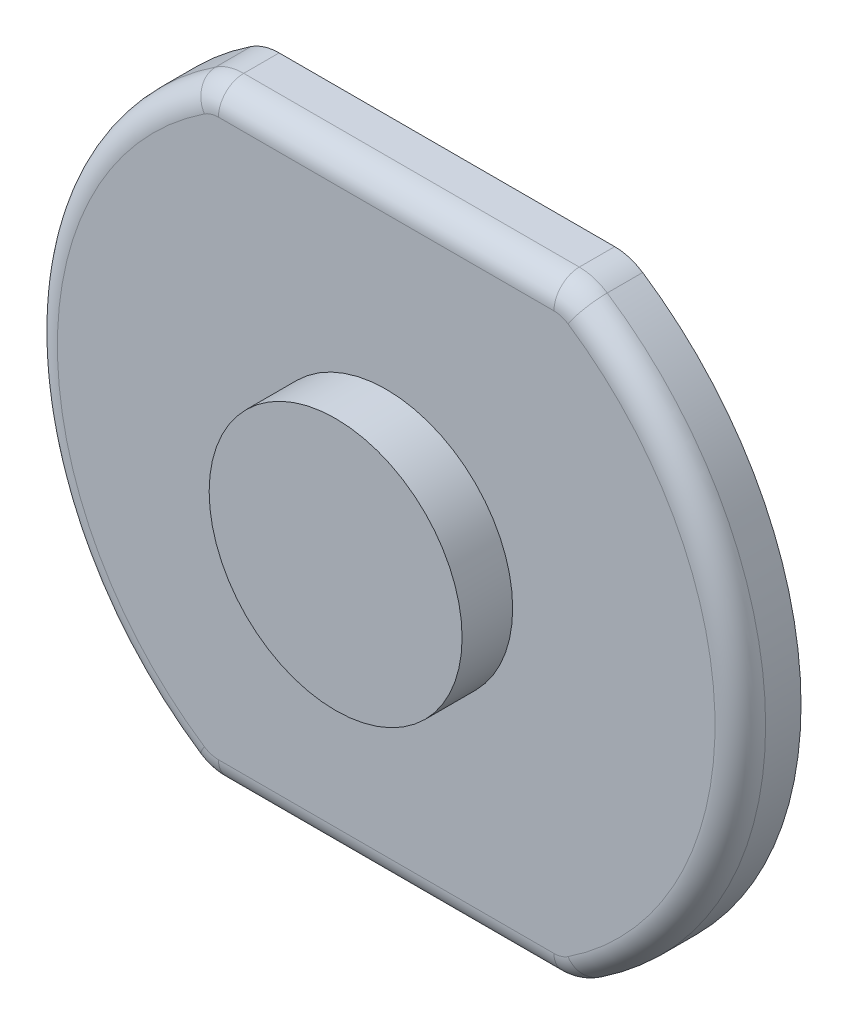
ISO-10303-21;
HEADER;
FILE_DESCRIPTION(('STEP AP214'),'2;1');
FILE_NAME('part.step','',(''),(''),'','','');
FILE_SCHEMA(('AUTOMOTIVE_DESIGN { 1 0 10303 214 1 1 1 1 }'));
ENDSEC;
DATA;
#1=APPLICATION_CONTEXT('core data for automotive mechanical design processes');
#2=APPLICATION_PROTOCOL_DEFINITION('international standard','automotive_design',2000,#1);
#3=PRODUCT_CONTEXT('',#1,'mechanical');
#4=PRODUCT('Part','Part','',(#3));
#5=PRODUCT_RELATED_PRODUCT_CATEGORY('part','',(#4));
#6=PRODUCT_DEFINITION_FORMATION('','',#4);
#7=PRODUCT_DEFINITION_CONTEXT('part definition',#1,'design');
#8=PRODUCT_DEFINITION('design','',#6,#7);
#9=PRODUCT_DEFINITION_SHAPE('','',#8);
#10=(LENGTH_UNIT() NAMED_UNIT(*) SI_UNIT(.MILLI.,.METRE.));
#11=(NAMED_UNIT(*) PLANE_ANGLE_UNIT() SI_UNIT($,.RADIAN.));
#12=(NAMED_UNIT(*) SI_UNIT($,.STERADIAN.) SOLID_ANGLE_UNIT());
#13=UNCERTAINTY_MEASURE_WITH_UNIT(LENGTH_MEASURE(1.E-05),#10,'distance_accuracy_value','');
#14=(GEOMETRIC_REPRESENTATION_CONTEXT(3) GLOBAL_UNCERTAINTY_ASSIGNED_CONTEXT((#13)) GLOBAL_UNIT_ASSIGNED_CONTEXT((#10,
#11,#12)) REPRESENTATION_CONTEXT('',''));
#15=CARTESIAN_POINT('',(0.,0.,0.));
#16=DIRECTION('',(0.,0.,1.));
#17=DIRECTION('',(1.,0.,0.));
#18=AXIS2_PLACEMENT_3D('',#15,#16,#17);
#19=CARTESIAN_POINT('',(0.,0.,1.2));
#20=DIRECTION('',(0.,0.,1.));
#21=DIRECTION('',(1.,0.,0.));
#22=AXIS2_PLACEMENT_3D('',#19,#20,#21);
#23=PLANE('',#22);
#24=DIRECTION('',(-1.,0.,0.));
#25=VECTOR('',#24,1.);
#26=CARTESIAN_POINT('',(-3.3166247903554,5.5,1.2));
#27=LINE('',#26,#25);
#28=CARTESIAN_POINT('',(3.3166247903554,5.5,1.2));
#29=VERTEX_POINT('',#28);
#30=CARTESIAN_POINT('',(-3.3166247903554,5.5,1.2));
#31=VERTEX_POINT('',#30);
#32=EDGE_CURVE('E187',#29,#31,#27,.T.);
#33=ORIENTED_EDGE('',*,*,#32,.T.);
#34=CARTESIAN_POINT('',(-3.3166247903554,5.,1.2));
#35=DIRECTION('',(0.,0.,1.));
#36=DIRECTION('',(1.,0.,0.));
#37=AXIS2_PLACEMENT_3D('',#34,#35,#36);
#38=CIRCLE('',#37,0.5);
#39=CARTESIAN_POINT('',(-3.59301018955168,5.41666666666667,1.2));
#40=VERTEX_POINT('',#39);
#41=EDGE_CURVE('E189',#31,#40,#38,.T.);
#42=ORIENTED_EDGE('',*,*,#41,.T.);
#43=CARTESIAN_POINT('',(0.,0.,1.2));
#44=DIRECTION('',(0.,0.,1.));
#45=DIRECTION('',(1.,0.,0.));
#46=AXIS2_PLACEMENT_3D('',#43,#44,#45);
#47=CIRCLE('',#46,6.5);
#48=CARTESIAN_POINT('',(-3.59301018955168,-5.41666666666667,1.2));
#49=VERTEX_POINT('',#48);
#50=EDGE_CURVE('E127',#40,#49,#47,.T.);
#51=ORIENTED_EDGE('',*,*,#50,.T.);
#52=CARTESIAN_POINT('',(-3.3166247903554,-5.,1.2));
#53=DIRECTION('',(0.,0.,1.));
#54=DIRECTION('',(1.,0.,0.));
#55=AXIS2_PLACEMENT_3D('',#52,#53,#54);
#56=CIRCLE('',#55,0.5);
#57=CARTESIAN_POINT('',(-3.3166247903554,-5.5,1.2));
#58=VERTEX_POINT('',#57);
#59=EDGE_CURVE('E177',#49,#58,#56,.T.);
#60=ORIENTED_EDGE('',*,*,#59,.T.);
#61=DIRECTION('',(1.,0.,0.));
#62=VECTOR('',#61,1.);
#63=CARTESIAN_POINT('',(3.31662479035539,-5.5,1.2));
#64=LINE('',#63,#62);
#65=CARTESIAN_POINT('',(3.31662479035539,-5.5,1.2));
#66=VERTEX_POINT('',#65);
#67=EDGE_CURVE('E179',#58,#66,#64,.T.);
#68=ORIENTED_EDGE('',*,*,#67,.T.);
#69=CARTESIAN_POINT('',(3.31662479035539,-5.,1.2));
#70=DIRECTION('',(0.,0.,1.));
#71=DIRECTION('',(1.,0.,0.));
#72=AXIS2_PLACEMENT_3D('',#69,#70,#71);
#73=CIRCLE('',#72,0.5);
#74=CARTESIAN_POINT('',(3.59301018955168,-5.41666666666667,1.2));
#75=VERTEX_POINT('',#74);
#76=EDGE_CURVE('E181',#66,#75,#73,.T.);
#77=ORIENTED_EDGE('',*,*,#76,.T.);
#78=CARTESIAN_POINT('',(0.,0.,1.2));
#79=DIRECTION('',(0.,0.,1.));
#80=DIRECTION('',(1.,0.,0.));
#81=AXIS2_PLACEMENT_3D('',#78,#79,#80);
#82=CIRCLE('',#81,6.5);
#83=CARTESIAN_POINT('',(3.59301018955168,5.41666666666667,1.2));
#84=VERTEX_POINT('',#83);
#85=EDGE_CURVE('E183',#75,#84,#82,.T.);
#86=ORIENTED_EDGE('',*,*,#85,.T.);
#87=CARTESIAN_POINT('',(3.3166247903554,5.,1.2));
#88=DIRECTION('',(0.,0.,1.));
#89=DIRECTION('',(1.,0.,0.));
#90=AXIS2_PLACEMENT_3D('',#87,#88,#89);
#91=CIRCLE('',#90,0.499999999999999);
#92=EDGE_CURVE('E185',#84,#29,#91,.T.);
#93=ORIENTED_EDGE('',*,*,#92,.T.);
#94=EDGE_LOOP('',(#33,#42,#51,#60,#68,#77,#86,#93));
#95=FACE_BOUND('',#94,.T.);
#96=CARTESIAN_POINT('',(0.,0.,1.2));
#97=DIRECTION('',(0.,0.,1.));
#98=DIRECTION('',(1.,0.,0.));
#99=AXIS2_PLACEMENT_3D('',#96,#97,#98);
#100=CIRCLE('',#99,2.5);
#101=CARTESIAN_POINT('',(2.5,0.,1.2));
#102=VERTEX_POINT('',#101);
#103=EDGE_CURVE('E275',#102,#102,#100,.T.);
#104=ORIENTED_EDGE('',*,*,#103,.F.);
#105=EDGE_LOOP('',(#104));
#106=FACE_BOUND('',#105,.T.);
#107=ADVANCED_FACE('F33',(#95,#106),#23,.T.);
#108=CARTESIAN_POINT('',(0.,0.,1.2));
#109=DIRECTION('',(0.,0.,-1.));
#110=DIRECTION('',(-1.,0.,0.));
#111=AXIS2_PLACEMENT_3D('',#108,#109,#110);
#112=CYLINDRICAL_SURFACE('',#111,7.);
#113=DIRECTION('',(0.,0.,-1.));
#114=VECTOR('',#113,1.);
#115=CARTESIAN_POINT('',(-3.86939558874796,-5.83333333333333,1.2));
#116=LINE('',#115,#114);
#117=CARTESIAN_POINT('',(-3.86939558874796,-5.83333333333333,0.7));
#118=VERTEX_POINT('',#117);
#119=CARTESIAN_POINT('',(-3.86939558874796,-5.83333333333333,0.));
#120=VERTEX_POINT('',#119);
#121=EDGE_CURVE('E119',#118,#120,#116,.T.);
#122=ORIENTED_EDGE('',*,*,#121,.F.);
#123=CARTESIAN_POINT('',(0.,0.,0.7));
#124=DIRECTION('',(0.,0.,1.));
#125=DIRECTION('',(1.,0.,0.));
#126=AXIS2_PLACEMENT_3D('',#123,#124,#125);
#127=CIRCLE('',#126,7.);
#128=CARTESIAN_POINT('',(-3.86939558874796,5.83333333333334,0.7));
#129=VERTEX_POINT('',#128);
#130=EDGE_CURVE('E11',#118,#129,#127,.F.);
#131=ORIENTED_EDGE('',*,*,#130,.T.);
#132=DIRECTION('',(0.,0.,-1.));
#133=VECTOR('',#132,1.);
#134=CARTESIAN_POINT('',(-3.86939558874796,5.83333333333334,1.2));
#135=LINE('',#134,#133);
#136=CARTESIAN_POINT('',(-3.86939558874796,5.83333333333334,0.));
#137=VERTEX_POINT('',#136);
#138=EDGE_CURVE('E140',#129,#137,#135,.T.);
#139=ORIENTED_EDGE('',*,*,#138,.T.);
#140=CARTESIAN_POINT('',(0.,0.,0.));
#141=DIRECTION('',(0.,0.,1.));
#142=DIRECTION('',(1.,0.,0.));
#143=AXIS2_PLACEMENT_3D('',#140,#141,#142);
#144=CIRCLE('',#143,7.);
#145=EDGE_CURVE('E134',#137,#120,#144,.T.);
#146=ORIENTED_EDGE('',*,*,#145,.T.);
#147=EDGE_LOOP('',(#122,#131,#139,#146));
#148=FACE_BOUND('',#147,.T.);
#149=ADVANCED_FACE('F35',(#148),#112,.T.);
#150=CARTESIAN_POINT('',(-3.3166247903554,-5.,1.2));
#151=DIRECTION('',(0.,0.,-1.));
#152=DIRECTION('',(-1.,0.,0.));
#153=AXIS2_PLACEMENT_3D('',#150,#151,#152);
#154=CYLINDRICAL_SURFACE('',#153,1.);
#155=DIRECTION('',(0.,0.,-1.));
#156=VECTOR('',#155,1.);
#157=CARTESIAN_POINT('',(-3.3166247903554,-6.,1.2));
#158=LINE('',#157,#156);
#159=CARTESIAN_POINT('',(-3.3166247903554,-6.,0.7));
#160=VERTEX_POINT('',#159);
#161=CARTESIAN_POINT('',(-3.3166247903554,-6.,0.));
#162=VERTEX_POINT('',#161);
#163=EDGE_CURVE('E128',#160,#162,#158,.T.);
#164=ORIENTED_EDGE('',*,*,#163,.F.);
#165=CARTESIAN_POINT('',(-3.3166247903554,-5.,0.7));
#166=DIRECTION('',(0.,0.,1.));
#167=DIRECTION('',(1.,0.,0.));
#168=AXIS2_PLACEMENT_3D('',#165,#166,#167);
#169=CIRCLE('',#168,1.);
#170=EDGE_CURVE('E41',#160,#118,#169,.F.);
#171=ORIENTED_EDGE('',*,*,#170,.T.);
#172=ORIENTED_EDGE('',*,*,#121,.T.);
#173=CARTESIAN_POINT('',(-3.3166247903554,-5.,0.));
#174=DIRECTION('',(0.,0.,1.));
#175=DIRECTION('',(1.,0.,0.));
#176=AXIS2_PLACEMENT_3D('',#173,#174,#175);
#177=CIRCLE('',#176,1.);
#178=EDGE_CURVE('E122',#120,#162,#177,.T.);
#179=ORIENTED_EDGE('',*,*,#178,.T.);
#180=EDGE_LOOP('',(#164,#171,#172,#179));
#181=FACE_BOUND('',#180,.T.);
#182=ADVANCED_FACE('F121',(#181),#154,.T.);
#183=CARTESIAN_POINT('',(-3.3166247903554,-6.,1.2));
#184=DIRECTION('',(0.,1.,0.));
#185=DIRECTION('',(0.,0.,1.));
#186=AXIS2_PLACEMENT_3D('',#183,#184,#185);
#187=PLANE('',#186);
#188=DIRECTION('',(0.,0.,-1.));
#189=VECTOR('',#188,1.);
#190=CARTESIAN_POINT('',(3.31662479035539,-6.,1.2));
#191=LINE('',#190,#189);
#192=CARTESIAN_POINT('',(3.31662479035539,-6.,0.7));
#193=VERTEX_POINT('',#192);
#194=CARTESIAN_POINT('',(3.31662479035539,-6.,0.));
#195=VERTEX_POINT('',#194);
#196=EDGE_CURVE('E173',#193,#195,#191,.T.);
#197=ORIENTED_EDGE('',*,*,#196,.F.);
#198=DIRECTION('',(1.,0.,0.));
#199=VECTOR('',#198,1.);
#200=CARTESIAN_POINT('',(-3.3166247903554,-6.,0.7));
#201=LINE('',#200,#199);
#202=EDGE_CURVE('E55',#193,#160,#201,.F.);
#203=ORIENTED_EDGE('',*,*,#202,.T.);
#204=ORIENTED_EDGE('',*,*,#163,.T.);
#205=DIRECTION('',(1.,0.,0.));
#206=VECTOR('',#205,1.);
#207=CARTESIAN_POINT('',(-3.3166247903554,-6.,0.));
#208=LINE('',#207,#206);
#209=EDGE_CURVE('E137',#162,#195,#208,.T.);
#210=ORIENTED_EDGE('',*,*,#209,.T.);
#211=EDGE_LOOP('',(#197,#203,#204,#210));
#212=FACE_BOUND('',#211,.T.);
#213=ADVANCED_FACE('F210',(#212),#187,.F.);
#214=CARTESIAN_POINT('',(3.31662479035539,-5.,1.2));
#215=DIRECTION('',(0.,0.,-1.));
#216=DIRECTION('',(-1.,0.,0.));
#217=AXIS2_PLACEMENT_3D('',#214,#215,#216);
#218=CYLINDRICAL_SURFACE('',#217,1.);
#219=DIRECTION('',(0.,0.,-1.));
#220=VECTOR('',#219,1.);
#221=CARTESIAN_POINT('',(3.86939558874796,-5.83333333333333,1.2));
#222=LINE('',#221,#220);
#223=CARTESIAN_POINT('',(3.86939558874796,-5.83333333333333,0.7));
#224=VERTEX_POINT('',#223);
#225=CARTESIAN_POINT('',(3.86939558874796,-5.83333333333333,0.));
#226=VERTEX_POINT('',#225);
#227=EDGE_CURVE('E171',#224,#226,#222,.T.);
#228=ORIENTED_EDGE('',*,*,#227,.F.);
#229=CARTESIAN_POINT('',(3.31662479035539,-5.,0.7));
#230=DIRECTION('',(0.,0.,1.));
#231=DIRECTION('',(1.,0.,0.));
#232=AXIS2_PLACEMENT_3D('',#229,#230,#231);
#233=CIRCLE('',#232,1.);
#234=EDGE_CURVE('E201',#224,#193,#233,.F.);
#235=ORIENTED_EDGE('',*,*,#234,.T.);
#236=ORIENTED_EDGE('',*,*,#196,.T.);
#237=CARTESIAN_POINT('',(3.31662479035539,-5.,0.));
#238=DIRECTION('',(0.,0.,1.));
#239=DIRECTION('',(1.,0.,0.));
#240=AXIS2_PLACEMENT_3D('',#237,#238,#239);
#241=CIRCLE('',#240,1.);
#242=EDGE_CURVE('E150',#195,#226,#241,.T.);
#243=ORIENTED_EDGE('',*,*,#242,.T.);
#244=EDGE_LOOP('',(#228,#235,#236,#243));
#245=FACE_BOUND('',#244,.T.);
#246=ADVANCED_FACE('F206',(#245),#218,.T.);
#247=CARTESIAN_POINT('',(0.,0.,1.2));
#248=DIRECTION('',(0.,0.,-1.));
#249=DIRECTION('',(-1.,0.,0.));
#250=AXIS2_PLACEMENT_3D('',#247,#248,#249);
#251=CYLINDRICAL_SURFACE('',#250,7.);
#252=DIRECTION('',(0.,0.,-1.));
#253=VECTOR('',#252,1.);
#254=CARTESIAN_POINT('',(3.86939558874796,5.83333333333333,1.2));
#255=LINE('',#254,#253);
#256=CARTESIAN_POINT('',(3.86939558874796,5.83333333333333,0.7));
#257=VERTEX_POINT('',#256);
#258=CARTESIAN_POINT('',(3.86939558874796,5.83333333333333,0.));
#259=VERTEX_POINT('',#258);
#260=EDGE_CURVE('E169',#257,#259,#255,.T.);
#261=ORIENTED_EDGE('',*,*,#260,.F.);
#262=CARTESIAN_POINT('',(0.,0.,0.7));
#263=DIRECTION('',(0.,0.,1.));
#264=DIRECTION('',(1.,0.,0.));
#265=AXIS2_PLACEMENT_3D('',#262,#263,#264);
#266=CIRCLE('',#265,7.);
#267=EDGE_CURVE('E199',#257,#224,#266,.F.);
#268=ORIENTED_EDGE('',*,*,#267,.T.);
#269=ORIENTED_EDGE('',*,*,#227,.T.);
#270=CARTESIAN_POINT('',(0.,0.,0.));
#271=DIRECTION('',(0.,0.,1.));
#272=DIRECTION('',(1.,0.,0.));
#273=AXIS2_PLACEMENT_3D('',#270,#271,#272);
#274=CIRCLE('',#273,7.);
#275=EDGE_CURVE('E153',#226,#259,#274,.T.);
#276=ORIENTED_EDGE('',*,*,#275,.T.);
#277=EDGE_LOOP('',(#261,#268,#269,#276));
#278=FACE_BOUND('',#277,.T.);
#279=ADVANCED_FACE('F296',(#278),#251,.T.);
#280=CARTESIAN_POINT('',(3.3166247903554,5.,1.2));
#281=DIRECTION('',(0.,0.,-1.));
#282=DIRECTION('',(-1.,0.,0.));
#283=AXIS2_PLACEMENT_3D('',#280,#281,#282);
#284=CYLINDRICAL_SURFACE('',#283,0.999999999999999);
#285=DIRECTION('',(0.,0.,-1.));
#286=VECTOR('',#285,1.);
#287=CARTESIAN_POINT('',(3.3166247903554,6.,1.2));
#288=LINE('',#287,#286);
#289=CARTESIAN_POINT('',(3.3166247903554,6.,0.7));
#290=VERTEX_POINT('',#289);
#291=CARTESIAN_POINT('',(3.3166247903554,6.,0.));
#292=VERTEX_POINT('',#291);
#293=EDGE_CURVE('E167',#290,#292,#288,.T.);
#294=ORIENTED_EDGE('',*,*,#293,.F.);
#295=CARTESIAN_POINT('',(3.3166247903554,5.,0.7));
#296=DIRECTION('',(0.,0.,1.));
#297=DIRECTION('',(1.,0.,0.));
#298=AXIS2_PLACEMENT_3D('',#295,#296,#297);
#299=CIRCLE('',#298,0.999999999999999);
#300=EDGE_CURVE('E197',#290,#257,#299,.F.);
#301=ORIENTED_EDGE('',*,*,#300,.T.);
#302=ORIENTED_EDGE('',*,*,#260,.T.);
#303=CARTESIAN_POINT('',(3.3166247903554,5.,0.));
#304=DIRECTION('',(0.,0.,1.));
#305=DIRECTION('',(1.,0.,0.));
#306=AXIS2_PLACEMENT_3D('',#303,#304,#305);
#307=CIRCLE('',#306,0.999999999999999);
#308=EDGE_CURVE('E156',#259,#292,#307,.T.);
#309=ORIENTED_EDGE('',*,*,#308,.T.);
#310=EDGE_LOOP('',(#294,#301,#302,#309));
#311=FACE_BOUND('',#310,.T.);
#312=ADVANCED_FACE('F256',(#311),#284,.T.);
#313=CARTESIAN_POINT('',(3.3166247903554,6.,1.2));
#314=DIRECTION('',(0.,-1.,0.));
#315=DIRECTION('',(1.,0.,0.));
#316=AXIS2_PLACEMENT_3D('',#313,#314,#315);
#317=PLANE('',#316);
#318=DIRECTION('',(0.,0.,-1.));
#319=VECTOR('',#318,1.);
#320=CARTESIAN_POINT('',(-3.3166247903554,6.,1.2));
#321=LINE('',#320,#319);
#322=CARTESIAN_POINT('',(-3.3166247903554,6.,0.7));
#323=VERTEX_POINT('',#322);
#324=CARTESIAN_POINT('',(-3.3166247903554,6.,0.));
#325=VERTEX_POINT('',#324);
#326=EDGE_CURVE('E165',#323,#325,#321,.T.);
#327=ORIENTED_EDGE('',*,*,#326,.F.);
#328=DIRECTION('',(-1.,0.,0.));
#329=VECTOR('',#328,1.);
#330=CARTESIAN_POINT('',(3.3166247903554,6.,0.7));
#331=LINE('',#330,#329);
#332=EDGE_CURVE('E195',#323,#290,#331,.F.);
#333=ORIENTED_EDGE('',*,*,#332,.T.);
#334=ORIENTED_EDGE('',*,*,#293,.T.);
#335=DIRECTION('',(-1.,0.,0.));
#336=VECTOR('',#335,1.);
#337=CARTESIAN_POINT('',(3.3166247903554,6.,0.));
#338=LINE('',#337,#336);
#339=EDGE_CURVE('E159',#292,#325,#338,.T.);
#340=ORIENTED_EDGE('',*,*,#339,.T.);
#341=EDGE_LOOP('',(#327,#333,#334,#340));
#342=FACE_BOUND('',#341,.T.);
#343=ADVANCED_FACE('F253',(#342),#317,.F.);
#344=CARTESIAN_POINT('',(-3.3166247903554,5.,1.2));
#345=DIRECTION('',(0.,0.,-1.));
#346=DIRECTION('',(-1.,0.,0.));
#347=AXIS2_PLACEMENT_3D('',#344,#345,#346);
#348=CYLINDRICAL_SURFACE('',#347,1.);
#349=ORIENTED_EDGE('',*,*,#138,.F.);
#350=CARTESIAN_POINT('',(-3.3166247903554,5.,0.7));
#351=DIRECTION('',(0.,0.,1.));
#352=DIRECTION('',(1.,0.,0.));
#353=AXIS2_PLACEMENT_3D('',#350,#351,#352);
#354=CIRCLE('',#353,1.);
#355=EDGE_CURVE('E192',#129,#323,#354,.F.);
#356=ORIENTED_EDGE('',*,*,#355,.T.);
#357=ORIENTED_EDGE('',*,*,#326,.T.);
#358=CARTESIAN_POINT('',(-3.3166247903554,5.,0.));
#359=DIRECTION('',(0.,0.,1.));
#360=DIRECTION('',(1.,0.,0.));
#361=AXIS2_PLACEMENT_3D('',#358,#359,#360);
#362=CIRCLE('',#361,1.);
#363=EDGE_CURVE('E162',#325,#137,#362,.T.);
#364=ORIENTED_EDGE('',*,*,#363,.T.);
#365=EDGE_LOOP('',(#349,#356,#357,#364));
#366=FACE_BOUND('',#365,.T.);
#367=ADVANCED_FACE('F238',(#366),#348,.T.);
#368=CARTESIAN_POINT('',(0.,0.,0.));
#369=DIRECTION('',(0.,0.,1.));
#370=DIRECTION('',(1.,0.,0.));
#371=AXIS2_PLACEMENT_3D('',#368,#369,#370);
#372=PLANE('',#371);
#373=ORIENTED_EDGE('',*,*,#145,.F.);
#374=ORIENTED_EDGE('',*,*,#363,.F.);
#375=ORIENTED_EDGE('',*,*,#339,.F.);
#376=ORIENTED_EDGE('',*,*,#308,.F.);
#377=ORIENTED_EDGE('',*,*,#275,.F.);
#378=ORIENTED_EDGE('',*,*,#242,.F.);
#379=ORIENTED_EDGE('',*,*,#209,.F.);
#380=ORIENTED_EDGE('',*,*,#178,.F.);
#381=EDGE_LOOP('',(#373,#374,#375,#376,#377,#378,#379,#380));
#382=FACE_BOUND('',#381,.T.);
#383=ADVANCED_FACE('F132',(#382),#372,.F.);
#384=CARTESIAN_POINT('',(3.31662479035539,-5.,0.7));
#385=DIRECTION('',(0.,0.,1.));
#386=DIRECTION('',(1.,0.,0.));
#387=AXIS2_PLACEMENT_3D('',#384,#385,#386);
#388=TOROIDAL_SURFACE('',#387,0.5,0.5);
#389=CARTESIAN_POINT('',(3.31662479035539,-5.5,0.7));
#390=DIRECTION('',(-1.,0.,0.));
#391=DIRECTION('',(0.,0.,1.));
#392=AXIS2_PLACEMENT_3D('',#389,#390,#391);
#393=CIRCLE('',#392,0.5);
#394=EDGE_CURVE('E145',#193,#66,#393,.T.);
#395=ORIENTED_EDGE('',*,*,#394,.F.);
#396=ORIENTED_EDGE('',*,*,#234,.F.);
#397=CARTESIAN_POINT('',(3.59301018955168,-5.41666666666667,0.7));
#398=DIRECTION('',(0.833333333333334,0.552770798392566,0.));
#399=DIRECTION('',(-0.552770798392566,0.833333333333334,0.));
#400=AXIS2_PLACEMENT_3D('',#397,#398,#399);
#401=CIRCLE('',#400,0.5);
#402=EDGE_CURVE('E142',#75,#224,#401,.T.);
#403=ORIENTED_EDGE('',*,*,#402,.F.);
#404=ORIENTED_EDGE('',*,*,#76,.F.);
#405=EDGE_LOOP('',(#395,#396,#403,#404));
#406=FACE_BOUND('',#405,.T.);
#407=ADVANCED_FACE('F213',(#406),#388,.T.);
#408=CARTESIAN_POINT('',(0.,0.,0.7));
#409=DIRECTION('',(0.,0.,1.));
#410=DIRECTION('',(1.,0.,0.));
#411=AXIS2_PLACEMENT_3D('',#408,#409,#410);
#412=TOROIDAL_SURFACE('',#411,6.5,0.5);
#413=ORIENTED_EDGE('',*,*,#402,.T.);
#414=ORIENTED_EDGE('',*,*,#267,.F.);
#415=CARTESIAN_POINT('',(3.59301018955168,5.41666666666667,0.7));
#416=DIRECTION('',(-0.833333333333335,0.552770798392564,0.));
#417=DIRECTION('',(-0.552770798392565,-0.833333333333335,0.));
#418=AXIS2_PLACEMENT_3D('',#415,#416,#417);
#419=CIRCLE('',#418,0.5);
#420=EDGE_CURVE('E216',#84,#257,#419,.T.);
#421=ORIENTED_EDGE('',*,*,#420,.F.);
#422=ORIENTED_EDGE('',*,*,#85,.F.);
#423=EDGE_LOOP('',(#413,#414,#421,#422));
#424=FACE_BOUND('',#423,.T.);
#425=ADVANCED_FACE('F343',(#424),#412,.T.);
#426=CARTESIAN_POINT('',(0.,-5.5,0.7));
#427=DIRECTION('',(-1.,0.,0.));
#428=DIRECTION('',(0.,0.,1.));
#429=AXIS2_PLACEMENT_3D('',#426,#427,#428);
#430=CYLINDRICAL_SURFACE('',#429,0.5);
#431=ORIENTED_EDGE('',*,*,#394,.T.);
#432=ORIENTED_EDGE('',*,*,#67,.F.);
#433=CARTESIAN_POINT('',(-3.3166247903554,-5.5,0.7));
#434=DIRECTION('',(-1.,0.,0.));
#435=DIRECTION('',(0.,0.,1.));
#436=AXIS2_PLACEMENT_3D('',#433,#434,#435);
#437=CIRCLE('',#436,0.5);
#438=EDGE_CURVE('E220',#160,#58,#437,.T.);
#439=ORIENTED_EDGE('',*,*,#438,.F.);
#440=ORIENTED_EDGE('',*,*,#202,.F.);
#441=EDGE_LOOP('',(#431,#432,#439,#440));
#442=FACE_BOUND('',#441,.T.);
#443=ADVANCED_FACE('F218',(#442),#430,.T.);
#444=CARTESIAN_POINT('',(3.3166247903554,5.,0.7));
#445=DIRECTION('',(0.,0.,1.));
#446=DIRECTION('',(1.,0.,0.));
#447=AXIS2_PLACEMENT_3D('',#444,#445,#446);
#448=DEGENERATE_TOROIDAL_SURFACE('',#447,0.499999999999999,0.5,.T.);
#449=ORIENTED_EDGE('',*,*,#420,.T.);
#450=ORIENTED_EDGE('',*,*,#300,.F.);
#451=CARTESIAN_POINT('',(3.3166247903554,5.5,0.7));
#452=DIRECTION('',(-1.,0.,0.));
#453=DIRECTION('',(0.,0.,1.));
#454=AXIS2_PLACEMENT_3D('',#451,#452,#453);
#455=CIRCLE('',#454,0.5);
#456=EDGE_CURVE('E223',#29,#290,#455,.T.);
#457=ORIENTED_EDGE('',*,*,#456,.F.);
#458=ORIENTED_EDGE('',*,*,#92,.F.);
#459=EDGE_LOOP('',(#449,#450,#457,#458));
#460=FACE_BOUND('',#459,.T.);
#461=ADVANCED_FACE('F262',(#460),#448,.T.);
#462=CARTESIAN_POINT('',(-3.3166247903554,-5.,0.7));
#463=DIRECTION('',(0.,0.,1.));
#464=DIRECTION('',(1.,0.,0.));
#465=AXIS2_PLACEMENT_3D('',#462,#463,#464);
#466=DEGENERATE_TOROIDAL_SURFACE('',#465,0.5,0.5,.T.);
#467=ORIENTED_EDGE('',*,*,#438,.T.);
#468=ORIENTED_EDGE('',*,*,#59,.F.);
#469=CARTESIAN_POINT('',(-3.59301018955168,-5.41666666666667,0.7));
#470=DIRECTION('',(-0.833333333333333,0.552770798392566,0.));
#471=DIRECTION('',(-0.552770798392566,-0.833333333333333,0.));
#472=AXIS2_PLACEMENT_3D('',#469,#470,#471);
#473=CIRCLE('',#472,0.5);
#474=EDGE_CURVE('E227',#118,#49,#473,.T.);
#475=ORIENTED_EDGE('',*,*,#474,.F.);
#476=ORIENTED_EDGE('',*,*,#170,.F.);
#477=EDGE_LOOP('',(#467,#468,#475,#476));
#478=FACE_BOUND('',#477,.T.);
#479=ADVANCED_FACE('F225',(#478),#466,.T.);
#480=CARTESIAN_POINT('',(0.,5.5,0.7));
#481=DIRECTION('',(1.,0.,0.));
#482=DIRECTION('',(0.,1.,0.));
#483=AXIS2_PLACEMENT_3D('',#480,#481,#482);
#484=CYLINDRICAL_SURFACE('',#483,0.5);
#485=ORIENTED_EDGE('',*,*,#456,.T.);
#486=ORIENTED_EDGE('',*,*,#332,.F.);
#487=CARTESIAN_POINT('',(-3.3166247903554,5.5,0.7));
#488=DIRECTION('',(-1.,0.,0.));
#489=DIRECTION('',(0.,0.,1.));
#490=AXIS2_PLACEMENT_3D('',#487,#488,#489);
#491=CIRCLE('',#490,0.5);
#492=EDGE_CURVE('E231',#31,#323,#491,.T.);
#493=ORIENTED_EDGE('',*,*,#492,.F.);
#494=ORIENTED_EDGE('',*,*,#32,.F.);
#495=EDGE_LOOP('',(#485,#486,#493,#494));
#496=FACE_BOUND('',#495,.T.);
#497=ADVANCED_FACE('F249',(#496),#484,.T.);
#498=CARTESIAN_POINT('',(0.,0.,0.7));
#499=DIRECTION('',(0.,0.,1.));
#500=DIRECTION('',(1.,0.,0.));
#501=AXIS2_PLACEMENT_3D('',#498,#499,#500);
#502=TOROIDAL_SURFACE('',#501,6.5,0.5);
#503=ORIENTED_EDGE('',*,*,#474,.T.);
#504=ORIENTED_EDGE('',*,*,#50,.F.);
#505=CARTESIAN_POINT('',(-3.59301018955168,5.41666666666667,0.7));
#506=DIRECTION('',(0.833333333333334,0.552770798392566,0.));
#507=DIRECTION('',(-0.552770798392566,0.833333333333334,0.));
#508=AXIS2_PLACEMENT_3D('',#505,#506,#507);
#509=CIRCLE('',#508,0.5);
#510=EDGE_CURVE('E235',#129,#40,#509,.T.);
#511=ORIENTED_EDGE('',*,*,#510,.F.);
#512=ORIENTED_EDGE('',*,*,#130,.F.);
#513=EDGE_LOOP('',(#503,#504,#511,#512));
#514=FACE_BOUND('',#513,.T.);
#515=ADVANCED_FACE('F234',(#514),#502,.T.);
#516=CARTESIAN_POINT('',(-3.3166247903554,5.,0.7));
#517=DIRECTION('',(0.,0.,1.));
#518=DIRECTION('',(1.,0.,0.));
#519=AXIS2_PLACEMENT_3D('',#516,#517,#518);
#520=DEGENERATE_TOROIDAL_SURFACE('',#519,0.5,0.5,.T.);
#521=ORIENTED_EDGE('',*,*,#492,.T.);
#522=ORIENTED_EDGE('',*,*,#355,.F.);
#523=ORIENTED_EDGE('',*,*,#510,.T.);
#524=ORIENTED_EDGE('',*,*,#41,.F.);
#525=EDGE_LOOP('',(#521,#522,#523,#524));
#526=FACE_BOUND('',#525,.T.);
#527=ADVANCED_FACE('F241',(#526),#520,.T.);
#528=CARTESIAN_POINT('',(0.,0.,2.2));
#529=DIRECTION('',(0.,0.,-1.));
#530=DIRECTION('',(-1.,0.,0.));
#531=AXIS2_PLACEMENT_3D('',#528,#529,#530);
#532=CYLINDRICAL_SURFACE('',#531,2.5);
#533=CARTESIAN_POINT('',(0.,0.,2.2));
#534=DIRECTION('',(0.,0.,1.));
#535=DIRECTION('',(1.,0.,0.));
#536=AXIS2_PLACEMENT_3D('',#533,#534,#535);
#537=CIRCLE('',#536,2.5);
#538=CARTESIAN_POINT('',(2.5,0.,2.2));
#539=VERTEX_POINT('',#538);
#540=EDGE_CURVE('E272',#539,#539,#537,.T.);
#541=ORIENTED_EDGE('',*,*,#540,.F.);
#542=EDGE_LOOP('',(#541));
#543=FACE_BOUND('',#542,.T.);
#544=ORIENTED_EDGE('',*,*,#103,.T.);
#545=EDGE_LOOP('',(#544));
#546=FACE_BOUND('',#545,.T.);
#547=ADVANCED_FACE('F279',(#543,#546),#532,.T.);
#548=CARTESIAN_POINT('',(0.,0.,2.2));
#549=DIRECTION('',(0.,0.,1.));
#550=DIRECTION('',(1.,0.,0.));
#551=AXIS2_PLACEMENT_3D('',#548,#549,#550);
#552=PLANE('',#551);
#553=ORIENTED_EDGE('',*,*,#540,.T.);
#554=EDGE_LOOP('',(#553));
#555=FACE_BOUND('',#554,.T.);
#556=ADVANCED_FACE('F391',(#555),#552,.T.);
#557=CLOSED_SHELL('',(#107,#149,#182,#213,#246,#279,#312,#343,#367,#383,#407,#425,#443,#461,
#479,#497,#515,#527,#547,#556));
#558=MANIFOLD_SOLID_BREP('B2',#557);
#559=ADVANCED_BREP_SHAPE_REPRESENTATION('',(#18,#558),#14);
#560=SHAPE_DEFINITION_REPRESENTATION(#9,#559);
ENDSEC;
END-ISO-10303-21;
